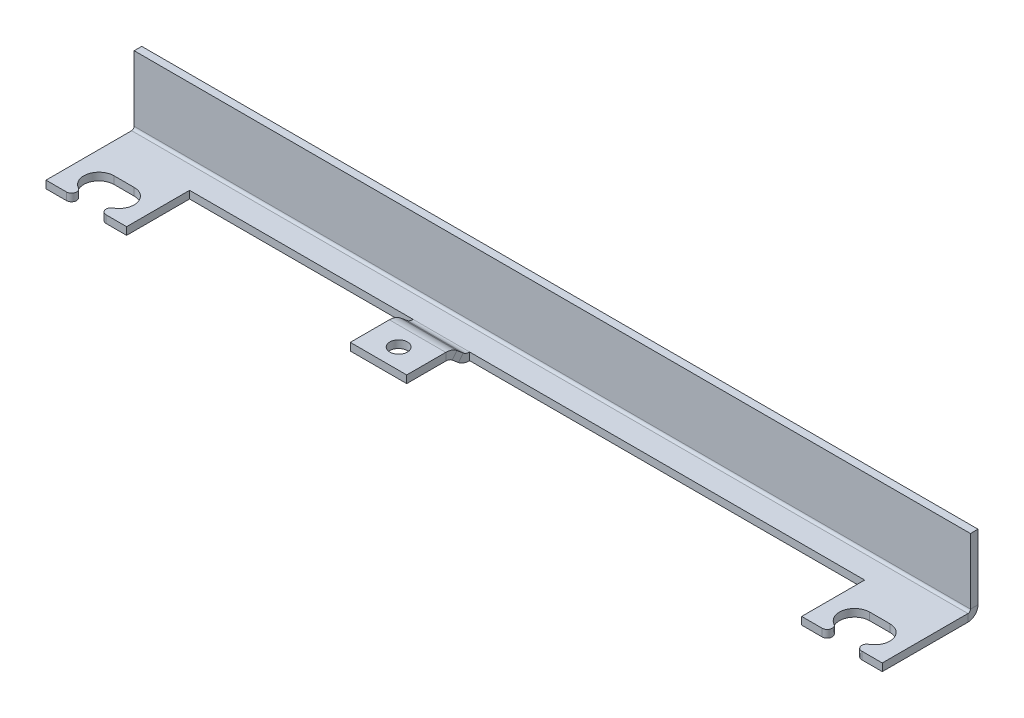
ISO-10303-21;
HEADER;
FILE_DESCRIPTION(('STEP AP214'),'2;1');
FILE_NAME('part.step','',(''),(''),'','','');
FILE_SCHEMA(('AUTOMOTIVE_DESIGN { 1 0 10303 214 1 1 1 1 }'));
ENDSEC;
DATA;
#1=APPLICATION_CONTEXT('core data for automotive mechanical design processes');
#2=APPLICATION_PROTOCOL_DEFINITION('international standard','automotive_design',2000,#1);
#3=PRODUCT_CONTEXT('',#1,'mechanical');
#4=PRODUCT('Part','Part','',(#3));
#5=PRODUCT_RELATED_PRODUCT_CATEGORY('part','',(#4));
#6=PRODUCT_DEFINITION_FORMATION('','',#4);
#7=PRODUCT_DEFINITION_CONTEXT('part definition',#1,'design');
#8=PRODUCT_DEFINITION('design','',#6,#7);
#9=PRODUCT_DEFINITION_SHAPE('','',#8);
#10=(LENGTH_UNIT() NAMED_UNIT(*) SI_UNIT(.MILLI.,.METRE.));
#11=(NAMED_UNIT(*) PLANE_ANGLE_UNIT() SI_UNIT($,.RADIAN.));
#12=(NAMED_UNIT(*) SI_UNIT($,.STERADIAN.) SOLID_ANGLE_UNIT());
#13=UNCERTAINTY_MEASURE_WITH_UNIT(LENGTH_MEASURE(1.E-05),#10,'distance_accuracy_value','');
#14=(GEOMETRIC_REPRESENTATION_CONTEXT(3) GLOBAL_UNCERTAINTY_ASSIGNED_CONTEXT((#13)) GLOBAL_UNIT_ASSIGNED_CONTEXT((#10,
#11,#12)) REPRESENTATION_CONTEXT('',''));
#15=CARTESIAN_POINT('',(0.,0.,0.));
#16=DIRECTION('',(0.,0.,1.));
#17=DIRECTION('',(1.,0.,0.));
#18=AXIS2_PLACEMENT_3D('',#15,#16,#17);
#19=CARTESIAN_POINT('',(177.4,37.3140353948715,-199.475186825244));
#20=DIRECTION('',(-1.,0.,0.));
#21=DIRECTION('',(0.,-1.,0.));
#22=AXIS2_PLACEMENT_3D('',#19,#20,#21);
#23=PLANE('',#22);
#24=DIRECTION('',(0.,0.642787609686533,0.766044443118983));
#25=VECTOR('',#24,1.);
#26=CARTESIAN_POINT('',(177.4,37.3140353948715,-199.475186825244));
#27=LINE('',#26,#25);
#28=CARTESIAN_POINT('',(177.4,35.8144460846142,-201.26232777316));
#29=VERTEX_POINT('',#28);
#30=CARTESIAN_POINT('',(177.4,36.8505226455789,-200.027579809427));
#31=VERTEX_POINT('',#30);
#32=EDGE_CURVE('E369',#29,#31,#27,.T.);
#33=ORIENTED_EDGE('',*,*,#32,.T.);
#34=DIRECTION('',(0.,0.76604444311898,-0.642787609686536));
#35=VECTOR('',#34,1.);
#36=CARTESIAN_POINT('',(177.4,36.8505226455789,-200.027579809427));
#37=LINE('',#36,#35);
#38=CARTESIAN_POINT('',(177.4,37.9995893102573,-200.991761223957));
#39=VERTEX_POINT('',#38);
#40=EDGE_CURVE('E357',#31,#39,#37,.T.);
#41=ORIENTED_EDGE('',*,*,#40,.T.);
#42=DIRECTION('',(0.,-0.642787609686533,-0.766044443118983));
#43=VECTOR('',#42,1.);
#44=CARTESIAN_POINT('',(177.4,36.5,-202.778902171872));
#45=LINE('',#44,#43);
#46=CARTESIAN_POINT('',(177.4,36.9635127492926,-202.226509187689));
#47=VERTEX_POINT('',#46);
#48=EDGE_CURVE('E373',#47,#39,#45,.F.);
#49=ORIENTED_EDGE('',*,*,#48,.F.);
#50=DIRECTION('',(0.,-0.766044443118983,0.642787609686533));
#51=VECTOR('',#50,1.);
#52=CARTESIAN_POINT('',(177.4,35.8144460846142,-201.26232777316));
#53=LINE('',#52,#51);
#54=EDGE_CURVE('E364',#47,#29,#53,.T.);
#55=ORIENTED_EDGE('',*,*,#54,.T.);
#56=EDGE_LOOP('',(#33,#41,#49,#55));
#57=FACE_BOUND('',#56,.T.);
#58=ADVANCED_FACE('F78',(#57),#23,.T.);
#59=CARTESIAN_POINT('',(188.6,35.3509333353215,-201.814720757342));
#60=DIRECTION('',(0.,-0.766044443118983,0.642787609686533));
#61=DIRECTION('',(0.,-0.642787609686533,-0.766044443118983));
#62=AXIS2_PLACEMENT_3D('',#59,#60,#61);
#63=PLANE('',#62);
#64=DIRECTION('',(0.,-0.642787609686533,-0.766044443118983));
#65=VECTOR('',#64,1.);
#66=CARTESIAN_POINT('',(188.6,35.3509333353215,-201.814720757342));
#67=LINE('',#66,#65);
#68=CARTESIAN_POINT('',(188.6,36.8505226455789,-200.027579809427));
#69=VERTEX_POINT('',#68);
#70=CARTESIAN_POINT('',(188.6,35.8144460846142,-201.26232777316));
#71=VERTEX_POINT('',#70);
#72=EDGE_CURVE('E366',#69,#71,#67,.T.);
#73=ORIENTED_EDGE('',*,*,#72,.F.);
#74=DIRECTION('',(-1.,0.,0.));
#75=VECTOR('',#74,1.);
#76=CARTESIAN_POINT('',(177.4,36.8505226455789,-200.027579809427));
#77=LINE('',#76,#75);
#78=EDGE_CURVE('E102',#31,#69,#77,.F.);
#79=ORIENTED_EDGE('',*,*,#78,.F.);
#80=ORIENTED_EDGE('',*,*,#32,.F.);
#81=DIRECTION('',(1.,0.,0.));
#82=VECTOR('',#81,1.);
#83=CARTESIAN_POINT('',(188.6,35.8144460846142,-201.26232777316));
#84=LINE('',#83,#82);
#85=EDGE_CURVE('E376',#29,#71,#84,.T.);
#86=ORIENTED_EDGE('',*,*,#85,.T.);
#87=EDGE_LOOP('',(#73,#79,#80,#86));
#88=FACE_BOUND('',#87,.T.);
#89=ADVANCED_FACE('F607',(#88),#63,.T.);
#90=CARTESIAN_POINT('',(188.6,36.5,-202.778902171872));
#91=DIRECTION('',(0.,-0.766044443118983,0.642787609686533));
#92=DIRECTION('',(0.,-0.642787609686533,-0.766044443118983));
#93=AXIS2_PLACEMENT_3D('',#90,#91,#92);
#94=PLANE('',#93);
#95=DIRECTION('',(-1.,0.,0.));
#96=VECTOR('',#95,1.);
#97=CARTESIAN_POINT('',(177.4,37.9995893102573,-200.991761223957));
#98=LINE('',#97,#96);
#99=CARTESIAN_POINT('',(188.6,37.9995893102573,-200.991761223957));
#100=VERTEX_POINT('',#99);
#101=EDGE_CURVE('E310',#39,#100,#98,.F.);
#102=ORIENTED_EDGE('',*,*,#101,.T.);
#103=DIRECTION('',(0.,0.642787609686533,0.766044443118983));
#104=VECTOR('',#103,1.);
#105=CARTESIAN_POINT('',(188.6,36.5,-202.778902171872));
#106=LINE('',#105,#104);
#107=CARTESIAN_POINT('',(188.6,36.9635127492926,-202.226509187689));
#108=VERTEX_POINT('',#107);
#109=EDGE_CURVE('E371',#100,#108,#106,.F.);
#110=ORIENTED_EDGE('',*,*,#109,.T.);
#111=DIRECTION('',(-1.,0.,0.));
#112=VECTOR('',#111,1.);
#113=CARTESIAN_POINT('',(177.4,36.9635127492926,-202.226509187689));
#114=LINE('',#113,#112);
#115=EDGE_CURVE('E382',#47,#108,#114,.F.);
#116=ORIENTED_EDGE('',*,*,#115,.F.);
#117=ORIENTED_EDGE('',*,*,#48,.T.);
#118=EDGE_LOOP('',(#102,#110,#116,#117));
#119=FACE_BOUND('',#118,.T.);
#120=ADVANCED_FACE('F655',(#119),#94,.F.);
#121=CARTESIAN_POINT('',(133.,36.5,-203.5));
#122=DIRECTION('',(0.,0.,-1.));
#123=DIRECTION('',(-1.,0.,0.));
#124=AXIS2_PLACEMENT_3D('',#121,#122,#123);
#125=PLANE('',#124);
#126=DIRECTION('',(0.,-1.,0.));
#127=VECTOR('',#126,1.);
#128=CARTESIAN_POINT('',(177.4,36.5,-203.5));
#129=LINE('',#128,#127);
#130=CARTESIAN_POINT('',(177.4,36.5,-203.5));
#131=VERTEX_POINT('',#130);
#132=CARTESIAN_POINT('',(177.4,35.,-203.5));
#133=VERTEX_POINT('',#132);
#134=EDGE_CURVE('E392',#131,#133,#129,.T.);
#135=ORIENTED_EDGE('',*,*,#134,.F.);
#136=DIRECTION('',(1.,0.,0.));
#137=VECTOR('',#136,1.);
#138=CARTESIAN_POINT('',(133.,36.5,-203.5));
#139=LINE('',#138,#137);
#140=CARTESIAN_POINT('',(133.,36.5,-203.5));
#141=VERTEX_POINT('',#140);
#142=EDGE_CURVE('E445',#141,#131,#139,.T.);
#143=ORIENTED_EDGE('',*,*,#142,.F.);
#144=DIRECTION('',(0.,-1.,0.));
#145=VECTOR('',#144,1.);
#146=CARTESIAN_POINT('',(133.,36.5,-203.5));
#147=LINE('',#146,#145);
#148=CARTESIAN_POINT('',(133.,35.,-203.5));
#149=VERTEX_POINT('',#148);
#150=EDGE_CURVE('E529',#141,#149,#147,.T.);
#151=ORIENTED_EDGE('',*,*,#150,.T.);
#152=DIRECTION('',(1.,0.,0.));
#153=VECTOR('',#152,1.);
#154=CARTESIAN_POINT('',(133.,35.,-203.5));
#155=LINE('',#154,#153);
#156=EDGE_CURVE('E446',#149,#133,#155,.T.);
#157=ORIENTED_EDGE('',*,*,#156,.T.);
#158=EDGE_LOOP('',(#135,#143,#151,#157));
#159=FACE_BOUND('',#158,.T.);
#160=ADVANCED_FACE('F443',(#159),#125,.F.);
#161=CARTESIAN_POINT('',(117.,36.5,-210.));
#162=DIRECTION('',(1.,0.,0.));
#163=DIRECTION('',(0.,0.,-1.));
#164=AXIS2_PLACEMENT_3D('',#161,#162,#163);
#165=PLANE('',#164);
#166=DIRECTION('',(0.,-1.,0.));
#167=VECTOR('',#166,1.);
#168=CARTESIAN_POINT('',(117.,36.5,-208.));
#169=LINE('',#168,#167);
#170=CARTESIAN_POINT('',(117.,36.5,-208.));
#171=VERTEX_POINT('',#170);
#172=CARTESIAN_POINT('',(117.,35.,-208.));
#173=VERTEX_POINT('',#172);
#174=EDGE_CURVE('E807',#171,#173,#169,.T.);
#175=ORIENTED_EDGE('',*,*,#174,.T.);
#176=DIRECTION('',(0.,0.,1.));
#177=VECTOR('',#176,1.);
#178=CARTESIAN_POINT('',(117.,35.,-210.));
#179=LINE('',#178,#177);
#180=CARTESIAN_POINT('',(117.,35.,-191.));
#181=VERTEX_POINT('',#180);
#182=EDGE_CURVE('E485',#173,#181,#179,.T.);
#183=ORIENTED_EDGE('',*,*,#182,.T.);
#184=DIRECTION('',(0.,-1.,0.));
#185=VECTOR('',#184,1.);
#186=CARTESIAN_POINT('',(117.,36.5,-191.));
#187=LINE('',#186,#185);
#188=CARTESIAN_POINT('',(117.,36.5,-191.));
#189=VERTEX_POINT('',#188);
#190=EDGE_CURVE('E13',#189,#181,#187,.T.);
#191=ORIENTED_EDGE('',*,*,#190,.F.);
#192=DIRECTION('',(0.,0.,1.));
#193=VECTOR('',#192,1.);
#194=CARTESIAN_POINT('',(117.,36.5,-210.));
#195=LINE('',#194,#193);
#196=EDGE_CURVE('E560',#171,#189,#195,.T.);
#197=ORIENTED_EDGE('',*,*,#196,.F.);
#198=EDGE_LOOP('',(#175,#183,#191,#197));
#199=FACE_BOUND('',#198,.T.);
#200=ADVANCED_FACE('F80',(#199),#165,.F.);
#201=CARTESIAN_POINT('',(283.,36.5,-210.));
#202=DIRECTION('',(-1.,0.,0.));
#203=DIRECTION('',(0.,0.,1.));
#204=AXIS2_PLACEMENT_3D('',#201,#202,#203);
#205=PLANE('',#204);
#206=DIRECTION('',(0.,-1.,0.));
#207=VECTOR('',#206,1.);
#208=CARTESIAN_POINT('',(283.,36.5,-208.));
#209=LINE('',#208,#207);
#210=CARTESIAN_POINT('',(283.,36.5,-208.));
#211=VERTEX_POINT('',#210);
#212=CARTESIAN_POINT('',(283.,35.,-208.));
#213=VERTEX_POINT('',#212);
#214=EDGE_CURVE('E488',#211,#213,#209,.T.);
#215=ORIENTED_EDGE('',*,*,#214,.F.);
#216=DIRECTION('',(0.,0.,-1.));
#217=VECTOR('',#216,1.);
#218=CARTESIAN_POINT('',(283.,36.5,-210.));
#219=LINE('',#218,#217);
#220=CARTESIAN_POINT('',(283.,36.5,-191.));
#221=VERTEX_POINT('',#220);
#222=EDGE_CURVE('E481',#221,#211,#219,.T.);
#223=ORIENTED_EDGE('',*,*,#222,.F.);
#224=DIRECTION('',(0.,-1.,0.));
#225=VECTOR('',#224,1.);
#226=CARTESIAN_POINT('',(283.,36.5,-191.));
#227=LINE('',#226,#225);
#228=CARTESIAN_POINT('',(283.,35.,-191.));
#229=VERTEX_POINT('',#228);
#230=EDGE_CURVE('E484',#221,#229,#227,.T.);
#231=ORIENTED_EDGE('',*,*,#230,.T.);
#232=DIRECTION('',(0.,0.,-1.));
#233=VECTOR('',#232,1.);
#234=CARTESIAN_POINT('',(283.,35.,-210.));
#235=LINE('',#234,#233);
#236=EDGE_CURVE('E557',#229,#213,#235,.T.);
#237=ORIENTED_EDGE('',*,*,#236,.T.);
#238=EDGE_LOOP('',(#215,#223,#231,#237));
#239=FACE_BOUND('',#238,.T.);
#240=ADVANCED_FACE('F706',(#239),#205,.F.);
#241=CARTESIAN_POINT('',(278.936491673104,36.5,-192.));
#242=DIRECTION('',(0.,-1.,0.));
#243=DIRECTION('',(0.,0.,-1.));
#244=AXIS2_PLACEMENT_3D('',#241,#242,#243);
#245=PLANE('',#244);
#246=DIRECTION('',(-1.,0.,0.));
#247=VECTOR('',#246,1.);
#248=CARTESIAN_POINT('',(117.,36.5,-208.));
#249=LINE('',#248,#247);
#250=EDGE_CURVE('E816',#171,#211,#249,.F.);
#251=ORIENTED_EDGE('',*,*,#250,.F.);
#252=ORIENTED_EDGE('',*,*,#196,.T.);
#253=DIRECTION('',(1.,0.,0.));
#254=VECTOR('',#253,1.);
#255=CARTESIAN_POINT('',(117.,36.5,-191.));
#256=LINE('',#255,#254);
#257=CARTESIAN_POINT('',(121.063508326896,36.5,-191.));
#258=VERTEX_POINT('',#257);
#259=EDGE_CURVE('E804',#189,#258,#256,.T.);
#260=ORIENTED_EDGE('',*,*,#259,.T.);
#261=CARTESIAN_POINT('',(121.063508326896,36.5,-192.));
#262=DIRECTION('',(0.,1.,0.));
#263=DIRECTION('',(0.,0.,1.));
#264=AXIS2_PLACEMENT_3D('',#261,#262,#263);
#265=CIRCLE('',#264,0.999999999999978);
#266=CARTESIAN_POINT('',(121.547631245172,36.5,-192.875));
#267=VERTEX_POINT('',#266);
#268=EDGE_CURVE('E776',#258,#267,#265,.T.);
#269=ORIENTED_EDGE('',*,*,#268,.T.);
#270=CARTESIAN_POINT('',(123.,36.5,-195.5));
#271=DIRECTION('',(0.,-1.,0.));
#272=DIRECTION('',(0.,0.,-1.));
#273=AXIS2_PLACEMENT_3D('',#270,#271,#272);
#274=CIRCLE('',#273,3.00000000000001);
#275=CARTESIAN_POINT('',(123.,36.5,-198.5));
#276=VERTEX_POINT('',#275);
#277=EDGE_CURVE('E787',#267,#276,#274,.T.);
#278=ORIENTED_EDGE('',*,*,#277,.T.);
#279=DIRECTION('',(1.,0.,0.));
#280=VECTOR('',#279,1.);
#281=CARTESIAN_POINT('',(123.,36.5,-198.5));
#282=LINE('',#281,#280);
#283=CARTESIAN_POINT('',(127.,36.5,-198.5));
#284=VERTEX_POINT('',#283);
#285=EDGE_CURVE('E784',#276,#284,#282,.T.);
#286=ORIENTED_EDGE('',*,*,#285,.T.);
#287=CARTESIAN_POINT('',(127.,36.5,-195.5));
#288=DIRECTION('',(0.,-1.,0.));
#289=DIRECTION('',(0.,0.,1.));
#290=AXIS2_PLACEMENT_3D('',#287,#288,#289);
#291=CIRCLE('',#290,3.);
#292=CARTESIAN_POINT('',(128.452368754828,36.5,-192.875));
#293=VERTEX_POINT('',#292);
#294=EDGE_CURVE('E786',#284,#293,#291,.T.);
#295=ORIENTED_EDGE('',*,*,#294,.T.);
#296=CARTESIAN_POINT('',(128.936491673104,36.5,-192.));
#297=DIRECTION('',(0.,1.,0.));
#298=DIRECTION('',(0.,0.,-1.));
#299=AXIS2_PLACEMENT_3D('',#296,#297,#298);
#300=CIRCLE('',#299,0.999999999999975);
#301=CARTESIAN_POINT('',(128.936491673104,36.5,-191.));
#302=VERTEX_POINT('',#301);
#303=EDGE_CURVE('E789',#293,#302,#300,.T.);
#304=ORIENTED_EDGE('',*,*,#303,.T.);
#305=DIRECTION('',(1.,0.,0.));
#306=VECTOR('',#305,1.);
#307=CARTESIAN_POINT('',(133.,36.5,-191.));
#308=LINE('',#307,#306);
#309=CARTESIAN_POINT('',(133.,36.5,-191.));
#310=VERTEX_POINT('',#309);
#311=EDGE_CURVE('E794',#302,#310,#308,.T.);
#312=ORIENTED_EDGE('',*,*,#311,.T.);
#313=DIRECTION('',(0.,0.,-1.));
#314=VECTOR('',#313,1.);
#315=CARTESIAN_POINT('',(133.,36.5,-191.));
#316=LINE('',#315,#314);
#317=EDGE_CURVE('E450',#310,#141,#316,.T.);
#318=ORIENTED_EDGE('',*,*,#317,.T.);
#319=ORIENTED_EDGE('',*,*,#142,.T.);
#320=DIRECTION('',(1.,0.,0.));
#321=VECTOR('',#320,1.);
#322=CARTESIAN_POINT('',(188.6,36.5,-203.5));
#323=LINE('',#322,#321);
#324=CARTESIAN_POINT('',(188.6,36.5,-203.5));
#325=VERTEX_POINT('',#324);
#326=EDGE_CURVE('E403',#325,#131,#323,.F.);
#327=ORIENTED_EDGE('',*,*,#326,.F.);
#328=CARTESIAN_POINT('',(267.,36.5,-203.5));
#329=VERTEX_POINT('',#328);
#330=EDGE_CURVE('E453',#325,#329,#139,.T.);
#331=ORIENTED_EDGE('',*,*,#330,.T.);
#332=DIRECTION('',(0.,0.,1.));
#333=VECTOR('',#332,1.);
#334=CARTESIAN_POINT('',(267.,36.5,-191.));
#335=LINE('',#334,#333);
#336=CARTESIAN_POINT('',(267.,36.5,-191.));
#337=VERTEX_POINT('',#336);
#338=EDGE_CURVE('E452',#329,#337,#335,.T.);
#339=ORIENTED_EDGE('',*,*,#338,.T.);
#340=DIRECTION('',(1.,0.,0.));
#341=VECTOR('',#340,1.);
#342=CARTESIAN_POINT('',(267.,36.5,-191.));
#343=LINE('',#342,#341);
#344=CARTESIAN_POINT('',(271.063508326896,36.5,-191.));
#345=VERTEX_POINT('',#344);
#346=EDGE_CURVE('E455',#337,#345,#343,.T.);
#347=ORIENTED_EDGE('',*,*,#346,.T.);
#348=CARTESIAN_POINT('',(271.063508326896,36.5,-192.));
#349=DIRECTION('',(0.,1.,0.));
#350=DIRECTION('',(0.,0.,1.));
#351=AXIS2_PLACEMENT_3D('',#348,#349,#350);
#352=CIRCLE('',#351,0.999999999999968);
#353=CARTESIAN_POINT('',(271.547631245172,36.5,-192.875));
#354=VERTEX_POINT('',#353);
#355=EDGE_CURVE('E469',#345,#354,#352,.T.);
#356=ORIENTED_EDGE('',*,*,#355,.T.);
#357=CARTESIAN_POINT('',(273.,36.5,-195.5));
#358=DIRECTION('',(0.,-1.,0.));
#359=DIRECTION('',(0.,0.,-1.));
#360=AXIS2_PLACEMENT_3D('',#357,#358,#359);
#361=CIRCLE('',#360,3.);
#362=CARTESIAN_POINT('',(273.,36.5,-198.5));
#363=VERTEX_POINT('',#362);
#364=EDGE_CURVE('E471',#354,#363,#361,.T.);
#365=ORIENTED_EDGE('',*,*,#364,.T.);
#366=DIRECTION('',(1.,0.,0.));
#367=VECTOR('',#366,1.);
#368=CARTESIAN_POINT('',(277.,36.5,-198.5));
#369=LINE('',#368,#367);
#370=CARTESIAN_POINT('',(277.,36.5,-198.5));
#371=VERTEX_POINT('',#370);
#372=EDGE_CURVE('E473',#363,#371,#369,.T.);
#373=ORIENTED_EDGE('',*,*,#372,.T.);
#374=CARTESIAN_POINT('',(277.,36.5,-195.5));
#375=DIRECTION('',(0.,-1.,0.));
#376=DIRECTION('',(0.,0.,1.));
#377=AXIS2_PLACEMENT_3D('',#374,#375,#376);
#378=CIRCLE('',#377,2.99999999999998);
#379=CARTESIAN_POINT('',(278.452368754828,36.5,-192.875));
#380=VERTEX_POINT('',#379);
#381=EDGE_CURVE('E475',#371,#380,#378,.T.);
#382=ORIENTED_EDGE('',*,*,#381,.T.);
#383=CARTESIAN_POINT('',(278.936491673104,36.5,-192.));
#384=DIRECTION('',(0.,1.,0.));
#385=DIRECTION('',(0.,0.,-1.));
#386=AXIS2_PLACEMENT_3D('',#383,#384,#385);
#387=CIRCLE('',#386,0.999999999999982);
#388=CARTESIAN_POINT('',(278.936491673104,36.5,-191.));
#389=VERTEX_POINT('',#388);
#390=EDGE_CURVE('E477',#380,#389,#387,.T.);
#391=ORIENTED_EDGE('',*,*,#390,.T.);
#392=DIRECTION('',(1.,0.,0.));
#393=VECTOR('',#392,1.);
#394=CARTESIAN_POINT('',(283.,36.5,-191.));
#395=LINE('',#394,#393);
#396=EDGE_CURVE('E479',#389,#221,#395,.T.);
#397=ORIENTED_EDGE('',*,*,#396,.T.);
#398=ORIENTED_EDGE('',*,*,#222,.T.);
#399=EDGE_LOOP('',(#251,#252,#260,#269,#278,#286,#295,#304,#312,#318,#319,#327,#331,#339,#347,
#356,#365,#373,#382,#391,#397,#398));
#400=FACE_BOUND('',#399,.T.);
#401=ADVANCED_FACE('F448',(#400),#245,.F.);
#402=CARTESIAN_POINT('',(278.936491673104,35.,-192.));
#403=DIRECTION('',(0.,-1.,0.));
#404=DIRECTION('',(0.,0.,-1.));
#405=AXIS2_PLACEMENT_3D('',#402,#403,#404);
#406=PLANE('',#405);
#407=ORIENTED_EDGE('',*,*,#182,.F.);
#408=DIRECTION('',(-1.,0.,0.));
#409=VECTOR('',#408,1.);
#410=CARTESIAN_POINT('',(117.,35.,-208.));
#411=LINE('',#410,#409);
#412=EDGE_CURVE('E825',#173,#213,#411,.F.);
#413=ORIENTED_EDGE('',*,*,#412,.T.);
#414=ORIENTED_EDGE('',*,*,#236,.F.);
#415=DIRECTION('',(1.,0.,0.));
#416=VECTOR('',#415,1.);
#417=CARTESIAN_POINT('',(283.,35.,-191.));
#418=LINE('',#417,#416);
#419=CARTESIAN_POINT('',(278.936491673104,35.,-191.));
#420=VERTEX_POINT('',#419);
#421=EDGE_CURVE('E561',#420,#229,#418,.T.);
#422=ORIENTED_EDGE('',*,*,#421,.F.);
#423=CARTESIAN_POINT('',(278.936491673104,35.,-192.));
#424=DIRECTION('',(0.,1.,0.));
#425=DIRECTION('',(0.,0.,-1.));
#426=AXIS2_PLACEMENT_3D('',#423,#424,#425);
#427=CIRCLE('',#426,0.999999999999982);
#428=CARTESIAN_POINT('',(278.452368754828,35.,-192.875));
#429=VERTEX_POINT('',#428);
#430=EDGE_CURVE('E563',#429,#420,#427,.T.);
#431=ORIENTED_EDGE('',*,*,#430,.F.);
#432=CARTESIAN_POINT('',(277.,35.,-195.5));
#433=DIRECTION('',(0.,-1.,0.));
#434=DIRECTION('',(0.,0.,1.));
#435=AXIS2_PLACEMENT_3D('',#432,#433,#434);
#436=CIRCLE('',#435,2.99999999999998);
#437=CARTESIAN_POINT('',(277.,35.,-198.5));
#438=VERTEX_POINT('',#437);
#439=EDGE_CURVE('E565',#438,#429,#436,.T.);
#440=ORIENTED_EDGE('',*,*,#439,.F.);
#441=DIRECTION('',(1.,0.,0.));
#442=VECTOR('',#441,1.);
#443=CARTESIAN_POINT('',(277.,35.,-198.5));
#444=LINE('',#443,#442);
#445=CARTESIAN_POINT('',(273.,35.,-198.5));
#446=VERTEX_POINT('',#445);
#447=EDGE_CURVE('E567',#446,#438,#444,.T.);
#448=ORIENTED_EDGE('',*,*,#447,.F.);
#449=CARTESIAN_POINT('',(273.,35.,-195.5));
#450=DIRECTION('',(0.,-1.,0.));
#451=DIRECTION('',(0.,0.,-1.));
#452=AXIS2_PLACEMENT_3D('',#449,#450,#451);
#453=CIRCLE('',#452,3.);
#454=CARTESIAN_POINT('',(271.547631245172,35.,-192.875));
#455=VERTEX_POINT('',#454);
#456=EDGE_CURVE('E569',#455,#446,#453,.T.);
#457=ORIENTED_EDGE('',*,*,#456,.F.);
#458=CARTESIAN_POINT('',(271.063508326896,35.,-192.));
#459=DIRECTION('',(0.,1.,0.));
#460=DIRECTION('',(0.,0.,1.));
#461=AXIS2_PLACEMENT_3D('',#458,#459,#460);
#462=CIRCLE('',#461,0.999999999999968);
#463=CARTESIAN_POINT('',(271.063508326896,35.,-191.));
#464=VERTEX_POINT('',#463);
#465=EDGE_CURVE('E571',#464,#455,#462,.T.);
#466=ORIENTED_EDGE('',*,*,#465,.F.);
#467=DIRECTION('',(1.,0.,0.));
#468=VECTOR('',#467,1.);
#469=CARTESIAN_POINT('',(267.,35.,-191.));
#470=LINE('',#469,#468);
#471=CARTESIAN_POINT('',(267.,35.,-191.));
#472=VERTEX_POINT('',#471);
#473=EDGE_CURVE('E572',#472,#464,#470,.T.);
#474=ORIENTED_EDGE('',*,*,#473,.F.);
#475=DIRECTION('',(0.,0.,1.));
#476=VECTOR('',#475,1.);
#477=CARTESIAN_POINT('',(267.,35.,-191.));
#478=LINE('',#477,#476);
#479=CARTESIAN_POINT('',(267.,35.,-203.5));
#480=VERTEX_POINT('',#479);
#481=EDGE_CURVE('E505',#480,#472,#478,.T.);
#482=ORIENTED_EDGE('',*,*,#481,.F.);
#483=CARTESIAN_POINT('',(188.6,35.,-203.5));
#484=VERTEX_POINT('',#483);
#485=EDGE_CURVE('E460',#484,#480,#155,.T.);
#486=ORIENTED_EDGE('',*,*,#485,.F.);
#487=DIRECTION('',(1.,0.,0.));
#488=VECTOR('',#487,1.);
#489=CARTESIAN_POINT('',(188.6,35.,-203.5));
#490=LINE('',#489,#488);
#491=EDGE_CURVE('E408',#484,#133,#490,.F.);
#492=ORIENTED_EDGE('',*,*,#491,.T.);
#493=ORIENTED_EDGE('',*,*,#156,.F.);
#494=DIRECTION('',(0.,0.,-1.));
#495=VECTOR('',#494,1.);
#496=CARTESIAN_POINT('',(133.,35.,-191.));
#497=LINE('',#496,#495);
#498=CARTESIAN_POINT('',(133.,35.,-191.));
#499=VERTEX_POINT('',#498);
#500=EDGE_CURVE('E502',#499,#149,#497,.T.);
#501=ORIENTED_EDGE('',*,*,#500,.F.);
#502=DIRECTION('',(1.,0.,0.));
#503=VECTOR('',#502,1.);
#504=CARTESIAN_POINT('',(133.,35.,-191.));
#505=LINE('',#504,#503);
#506=CARTESIAN_POINT('',(128.936491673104,35.,-191.));
#507=VERTEX_POINT('',#506);
#508=EDGE_CURVE('E500',#507,#499,#505,.T.);
#509=ORIENTED_EDGE('',*,*,#508,.F.);
#510=CARTESIAN_POINT('',(128.936491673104,35.,-192.));
#511=DIRECTION('',(0.,1.,0.));
#512=DIRECTION('',(0.,0.,-1.));
#513=AXIS2_PLACEMENT_3D('',#510,#511,#512);
#514=CIRCLE('',#513,0.999999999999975);
#515=CARTESIAN_POINT('',(128.452368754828,35.,-192.875));
#516=VERTEX_POINT('',#515);
#517=EDGE_CURVE('E498',#516,#507,#514,.T.);
#518=ORIENTED_EDGE('',*,*,#517,.F.);
#519=CARTESIAN_POINT('',(127.,35.,-195.5));
#520=DIRECTION('',(0.,-1.,0.));
#521=DIRECTION('',(0.,0.,1.));
#522=AXIS2_PLACEMENT_3D('',#519,#520,#521);
#523=CIRCLE('',#522,3.);
#524=CARTESIAN_POINT('',(127.,35.,-198.5));
#525=VERTEX_POINT('',#524);
#526=EDGE_CURVE('E496',#525,#516,#523,.T.);
#527=ORIENTED_EDGE('',*,*,#526,.F.);
#528=DIRECTION('',(1.,0.,0.));
#529=VECTOR('',#528,1.);
#530=CARTESIAN_POINT('',(123.,35.,-198.5));
#531=LINE('',#530,#529);
#532=CARTESIAN_POINT('',(123.,35.,-198.5));
#533=VERTEX_POINT('',#532);
#534=EDGE_CURVE('E494',#533,#525,#531,.T.);
#535=ORIENTED_EDGE('',*,*,#534,.F.);
#536=CARTESIAN_POINT('',(123.,35.,-195.5));
#537=DIRECTION('',(0.,-1.,0.));
#538=DIRECTION('',(0.,0.,-1.));
#539=AXIS2_PLACEMENT_3D('',#536,#537,#538);
#540=CIRCLE('',#539,3.00000000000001);
#541=CARTESIAN_POINT('',(121.547631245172,35.,-192.875));
#542=VERTEX_POINT('',#541);
#543=EDGE_CURVE('E492',#542,#533,#540,.T.);
#544=ORIENTED_EDGE('',*,*,#543,.F.);
#545=CARTESIAN_POINT('',(121.063508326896,35.,-192.));
#546=DIRECTION('',(0.,1.,0.));
#547=DIRECTION('',(0.,0.,1.));
#548=AXIS2_PLACEMENT_3D('',#545,#546,#547);
#549=CIRCLE('',#548,0.999999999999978);
#550=CARTESIAN_POINT('',(121.063508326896,35.,-191.));
#551=VERTEX_POINT('',#550);
#552=EDGE_CURVE('E490',#551,#542,#549,.T.);
#553=ORIENTED_EDGE('',*,*,#552,.F.);
#554=DIRECTION('',(1.,0.,0.));
#555=VECTOR('',#554,1.);
#556=CARTESIAN_POINT('',(117.,35.,-191.));
#557=LINE('',#556,#555);
#558=EDGE_CURVE('E487',#181,#551,#557,.T.);
#559=ORIENTED_EDGE('',*,*,#558,.F.);
#560=EDGE_LOOP('',(#407,#413,#414,#422,#431,#440,#448,#457,#466,#474,#482,#486,#492,#493,#501,
#509,#518,#527,#535,#544,#553,#559));
#561=FACE_BOUND('',#560,.T.);
#562=ADVANCED_FACE('F586',(#561),#406,.T.);
#563=CARTESIAN_POINT('',(117.,36.5,-191.));
#564=DIRECTION('',(0.,0.,-1.));
#565=DIRECTION('',(-1.,0.,0.));
#566=AXIS2_PLACEMENT_3D('',#563,#564,#565);
#567=PLANE('',#566);
#568=ORIENTED_EDGE('',*,*,#558,.T.);
#569=DIRECTION('',(0.,-1.,0.));
#570=VECTOR('',#569,1.);
#571=CARTESIAN_POINT('',(121.063508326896,36.5,-191.));
#572=LINE('',#571,#570);
#573=EDGE_CURVE('E87',#258,#551,#572,.T.);
#574=ORIENTED_EDGE('',*,*,#573,.F.);
#575=ORIENTED_EDGE('',*,*,#259,.F.);
#576=ORIENTED_EDGE('',*,*,#190,.T.);
#577=EDGE_LOOP('',(#568,#574,#575,#576));
#578=FACE_BOUND('',#577,.T.);
#579=ADVANCED_FACE('F709',(#578),#567,.F.);
#580=CARTESIAN_POINT('',(121.063508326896,36.5,-192.));
#581=DIRECTION('',(0.,-1.,0.));
#582=DIRECTION('',(0.,0.,-1.));
#583=AXIS2_PLACEMENT_3D('',#580,#581,#582);
#584=CYLINDRICAL_SURFACE('',#583,0.999999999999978);
#585=ORIENTED_EDGE('',*,*,#552,.T.);
#586=DIRECTION('',(0.,-1.,0.));
#587=VECTOR('',#586,1.);
#588=CARTESIAN_POINT('',(121.547631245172,36.5,-192.875));
#589=LINE('',#588,#587);
#590=EDGE_CURVE('E511',#267,#542,#589,.T.);
#591=ORIENTED_EDGE('',*,*,#590,.F.);
#592=ORIENTED_EDGE('',*,*,#268,.F.);
#593=ORIENTED_EDGE('',*,*,#573,.T.);
#594=EDGE_LOOP('',(#585,#591,#592,#593));
#595=FACE_BOUND('',#594,.T.);
#596=ADVANCED_FACE('F761',(#595),#584,.T.);
#597=CARTESIAN_POINT('',(123.,36.5,-195.5));
#598=DIRECTION('',(0.,-1.,0.));
#599=DIRECTION('',(0.,0.,-1.));
#600=AXIS2_PLACEMENT_3D('',#597,#598,#599);
#601=CYLINDRICAL_SURFACE('',#600,3.00000000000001);
#602=ORIENTED_EDGE('',*,*,#543,.T.);
#603=DIRECTION('',(0.,-1.,0.));
#604=VECTOR('',#603,1.);
#605=CARTESIAN_POINT('',(123.,36.5,-198.5));
#606=LINE('',#605,#604);
#607=EDGE_CURVE('E514',#276,#533,#606,.T.);
#608=ORIENTED_EDGE('',*,*,#607,.F.);
#609=ORIENTED_EDGE('',*,*,#277,.F.);
#610=ORIENTED_EDGE('',*,*,#590,.T.);
#611=EDGE_LOOP('',(#602,#608,#609,#610));
#612=FACE_BOUND('',#611,.T.);
#613=ADVANCED_FACE('F757',(#612),#601,.F.);
#614=CARTESIAN_POINT('',(123.,36.5,-198.5));
#615=DIRECTION('',(0.,0.,-1.));
#616=DIRECTION('',(-1.,0.,0.));
#617=AXIS2_PLACEMENT_3D('',#614,#615,#616);
#618=PLANE('',#617);
#619=ORIENTED_EDGE('',*,*,#534,.T.);
#620=DIRECTION('',(0.,-1.,0.));
#621=VECTOR('',#620,1.);
#622=CARTESIAN_POINT('',(127.,36.5,-198.5));
#623=LINE('',#622,#621);
#624=EDGE_CURVE('E517',#284,#525,#623,.T.);
#625=ORIENTED_EDGE('',*,*,#624,.F.);
#626=ORIENTED_EDGE('',*,*,#285,.F.);
#627=ORIENTED_EDGE('',*,*,#607,.T.);
#628=EDGE_LOOP('',(#619,#625,#626,#627));
#629=FACE_BOUND('',#628,.T.);
#630=ADVANCED_FACE('F753',(#629),#618,.F.);
#631=CARTESIAN_POINT('',(127.,36.5,-195.5));
#632=DIRECTION('',(0.,-1.,0.));
#633=DIRECTION('',(0.,0.,-1.));
#634=AXIS2_PLACEMENT_3D('',#631,#632,#633);
#635=CYLINDRICAL_SURFACE('',#634,3.);
#636=ORIENTED_EDGE('',*,*,#526,.T.);
#637=DIRECTION('',(0.,-1.,0.));
#638=VECTOR('',#637,1.);
#639=CARTESIAN_POINT('',(128.452368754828,36.5,-192.875));
#640=LINE('',#639,#638);
#641=EDGE_CURVE('E520',#293,#516,#640,.T.);
#642=ORIENTED_EDGE('',*,*,#641,.F.);
#643=ORIENTED_EDGE('',*,*,#294,.F.);
#644=ORIENTED_EDGE('',*,*,#624,.T.);
#645=EDGE_LOOP('',(#636,#642,#643,#644));
#646=FACE_BOUND('',#645,.T.);
#647=ADVANCED_FACE('F749',(#646),#635,.F.);
#648=CARTESIAN_POINT('',(128.936491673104,36.5,-192.));
#649=DIRECTION('',(0.,-1.,0.));
#650=DIRECTION('',(0.,0.,-1.));
#651=AXIS2_PLACEMENT_3D('',#648,#649,#650);
#652=CYLINDRICAL_SURFACE('',#651,0.999999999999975);
#653=ORIENTED_EDGE('',*,*,#517,.T.);
#654=DIRECTION('',(0.,-1.,0.));
#655=VECTOR('',#654,1.);
#656=CARTESIAN_POINT('',(128.936491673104,36.5,-191.));
#657=LINE('',#656,#655);
#658=EDGE_CURVE('E523',#302,#507,#657,.T.);
#659=ORIENTED_EDGE('',*,*,#658,.F.);
#660=ORIENTED_EDGE('',*,*,#303,.F.);
#661=ORIENTED_EDGE('',*,*,#641,.T.);
#662=EDGE_LOOP('',(#653,#659,#660,#661));
#663=FACE_BOUND('',#662,.T.);
#664=ADVANCED_FACE('F745',(#663),#652,.T.);
#665=CARTESIAN_POINT('',(133.,36.5,-191.));
#666=DIRECTION('',(0.,0.,-1.));
#667=DIRECTION('',(-1.,0.,0.));
#668=AXIS2_PLACEMENT_3D('',#665,#666,#667);
#669=PLANE('',#668);
#670=ORIENTED_EDGE('',*,*,#508,.T.);
#671=DIRECTION('',(0.,-1.,0.));
#672=VECTOR('',#671,1.);
#673=CARTESIAN_POINT('',(133.,36.5,-191.));
#674=LINE('',#673,#672);
#675=EDGE_CURVE('E526',#310,#499,#674,.T.);
#676=ORIENTED_EDGE('',*,*,#675,.F.);
#677=ORIENTED_EDGE('',*,*,#311,.F.);
#678=ORIENTED_EDGE('',*,*,#658,.T.);
#679=EDGE_LOOP('',(#670,#676,#677,#678));
#680=FACE_BOUND('',#679,.T.);
#681=ADVANCED_FACE('F741',(#680),#669,.F.);
#682=CARTESIAN_POINT('',(133.,36.5,-191.));
#683=DIRECTION('',(-1.,0.,0.));
#684=DIRECTION('',(0.,0.,1.));
#685=AXIS2_PLACEMENT_3D('',#682,#683,#684);
#686=PLANE('',#685);
#687=ORIENTED_EDGE('',*,*,#500,.T.);
#688=ORIENTED_EDGE('',*,*,#150,.F.);
#689=ORIENTED_EDGE('',*,*,#317,.F.);
#690=ORIENTED_EDGE('',*,*,#675,.T.);
#691=EDGE_LOOP('',(#687,#688,#689,#690));
#692=FACE_BOUND('',#691,.T.);
#693=ADVANCED_FACE('F738',(#692),#686,.F.);
#694=ORIENTED_EDGE('',*,*,#330,.F.);
#695=DIRECTION('',(0.,-1.,0.));
#696=VECTOR('',#695,1.);
#697=CARTESIAN_POINT('',(188.6,36.5,-203.5));
#698=LINE('',#697,#696);
#699=EDGE_CURVE('E396',#325,#484,#698,.T.);
#700=ORIENTED_EDGE('',*,*,#699,.T.);
#701=ORIENTED_EDGE('',*,*,#485,.T.);
#702=DIRECTION('',(0.,-1.,0.));
#703=VECTOR('',#702,1.);
#704=CARTESIAN_POINT('',(267.,36.5,-203.5));
#705=LINE('',#704,#703);
#706=EDGE_CURVE('E531',#329,#480,#705,.T.);
#707=ORIENTED_EDGE('',*,*,#706,.F.);
#708=EDGE_LOOP('',(#694,#700,#701,#707));
#709=FACE_BOUND('',#708,.T.);
#710=ADVANCED_FACE('F600',(#709),#125,.F.);
#711=CARTESIAN_POINT('',(267.,36.5,-191.));
#712=DIRECTION('',(1.,0.,0.));
#713=DIRECTION('',(0.,0.,-1.));
#714=AXIS2_PLACEMENT_3D('',#711,#712,#713);
#715=PLANE('',#714);
#716=ORIENTED_EDGE('',*,*,#481,.T.);
#717=DIRECTION('',(0.,-1.,0.));
#718=VECTOR('',#717,1.);
#719=CARTESIAN_POINT('',(267.,36.5,-191.));
#720=LINE('',#719,#718);
#721=EDGE_CURVE('E534',#337,#472,#720,.T.);
#722=ORIENTED_EDGE('',*,*,#721,.F.);
#723=ORIENTED_EDGE('',*,*,#338,.F.);
#724=ORIENTED_EDGE('',*,*,#706,.T.);
#725=EDGE_LOOP('',(#716,#722,#723,#724));
#726=FACE_BOUND('',#725,.T.);
#727=ADVANCED_FACE('F579',(#726),#715,.F.);
#728=CARTESIAN_POINT('',(267.,36.5,-191.));
#729=DIRECTION('',(0.,0.,-1.));
#730=DIRECTION('',(-1.,0.,0.));
#731=AXIS2_PLACEMENT_3D('',#728,#729,#730);
#732=PLANE('',#731);
#733=ORIENTED_EDGE('',*,*,#473,.T.);
#734=DIRECTION('',(0.,-1.,0.));
#735=VECTOR('',#734,1.);
#736=CARTESIAN_POINT('',(271.063508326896,36.5,-191.));
#737=LINE('',#736,#735);
#738=EDGE_CURVE('E537',#345,#464,#737,.T.);
#739=ORIENTED_EDGE('',*,*,#738,.F.);
#740=ORIENTED_EDGE('',*,*,#346,.F.);
#741=ORIENTED_EDGE('',*,*,#721,.T.);
#742=EDGE_LOOP('',(#733,#739,#740,#741));
#743=FACE_BOUND('',#742,.T.);
#744=ADVANCED_FACE('F583',(#743),#732,.F.);
#745=CARTESIAN_POINT('',(271.063508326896,36.5,-192.));
#746=DIRECTION('',(0.,-1.,0.));
#747=DIRECTION('',(0.,0.,-1.));
#748=AXIS2_PLACEMENT_3D('',#745,#746,#747);
#749=CYLINDRICAL_SURFACE('',#748,0.999999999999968);
#750=ORIENTED_EDGE('',*,*,#465,.T.);
#751=DIRECTION('',(0.,-1.,0.));
#752=VECTOR('',#751,1.);
#753=CARTESIAN_POINT('',(271.547631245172,36.5,-192.875));
#754=LINE('',#753,#752);
#755=EDGE_CURVE('E540',#354,#455,#754,.T.);
#756=ORIENTED_EDGE('',*,*,#755,.F.);
#757=ORIENTED_EDGE('',*,*,#355,.F.);
#758=ORIENTED_EDGE('',*,*,#738,.T.);
#759=EDGE_LOOP('',(#750,#756,#757,#758));
#760=FACE_BOUND('',#759,.T.);
#761=ADVANCED_FACE('F591',(#760),#749,.T.);
#762=CARTESIAN_POINT('',(273.,36.5,-195.5));
#763=DIRECTION('',(0.,-1.,0.));
#764=DIRECTION('',(0.,0.,-1.));
#765=AXIS2_PLACEMENT_3D('',#762,#763,#764);
#766=CYLINDRICAL_SURFACE('',#765,3.);
#767=ORIENTED_EDGE('',*,*,#456,.T.);
#768=DIRECTION('',(0.,-1.,0.));
#769=VECTOR('',#768,1.);
#770=CARTESIAN_POINT('',(273.,36.5,-198.5));
#771=LINE('',#770,#769);
#772=EDGE_CURVE('E543',#363,#446,#771,.T.);
#773=ORIENTED_EDGE('',*,*,#772,.F.);
#774=ORIENTED_EDGE('',*,*,#364,.F.);
#775=ORIENTED_EDGE('',*,*,#755,.T.);
#776=EDGE_LOOP('',(#767,#773,#774,#775));
#777=FACE_BOUND('',#776,.T.);
#778=ADVANCED_FACE('F595',(#777),#766,.F.);
#779=CARTESIAN_POINT('',(277.,36.5,-198.5));
#780=DIRECTION('',(0.,0.,-1.));
#781=DIRECTION('',(-1.,0.,0.));
#782=AXIS2_PLACEMENT_3D('',#779,#780,#781);
#783=PLANE('',#782);
#784=ORIENTED_EDGE('',*,*,#447,.T.);
#785=DIRECTION('',(0.,-1.,0.));
#786=VECTOR('',#785,1.);
#787=CARTESIAN_POINT('',(277.,36.5,-198.5));
#788=LINE('',#787,#786);
#789=EDGE_CURVE('E546',#371,#438,#788,.T.);
#790=ORIENTED_EDGE('',*,*,#789,.F.);
#791=ORIENTED_EDGE('',*,*,#372,.F.);
#792=ORIENTED_EDGE('',*,*,#772,.T.);
#793=EDGE_LOOP('',(#784,#790,#791,#792));
#794=FACE_BOUND('',#793,.T.);
#795=ADVANCED_FACE('F723',(#794),#783,.F.);
#796=CARTESIAN_POINT('',(277.,36.5,-195.5));
#797=DIRECTION('',(0.,-1.,0.));
#798=DIRECTION('',(0.,0.,-1.));
#799=AXIS2_PLACEMENT_3D('',#796,#797,#798);
#800=CYLINDRICAL_SURFACE('',#799,2.99999999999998);
#801=ORIENTED_EDGE('',*,*,#439,.T.);
#802=DIRECTION('',(0.,-1.,0.));
#803=VECTOR('',#802,1.);
#804=CARTESIAN_POINT('',(278.452368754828,36.5,-192.875));
#805=LINE('',#804,#803);
#806=EDGE_CURVE('E549',#380,#429,#805,.T.);
#807=ORIENTED_EDGE('',*,*,#806,.F.);
#808=ORIENTED_EDGE('',*,*,#381,.F.);
#809=ORIENTED_EDGE('',*,*,#789,.T.);
#810=EDGE_LOOP('',(#801,#807,#808,#809));
#811=FACE_BOUND('',#810,.T.);
#812=ADVANCED_FACE('F719',(#811),#800,.F.);
#813=CARTESIAN_POINT('',(278.936491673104,36.5,-192.));
#814=DIRECTION('',(0.,-1.,0.));
#815=DIRECTION('',(0.,0.,-1.));
#816=AXIS2_PLACEMENT_3D('',#813,#814,#815);
#817=CYLINDRICAL_SURFACE('',#816,0.999999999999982);
#818=ORIENTED_EDGE('',*,*,#430,.T.);
#819=DIRECTION('',(0.,-1.,0.));
#820=VECTOR('',#819,1.);
#821=CARTESIAN_POINT('',(278.936491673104,36.5,-191.));
#822=LINE('',#821,#820);
#823=EDGE_CURVE('E552',#389,#420,#822,.T.);
#824=ORIENTED_EDGE('',*,*,#823,.F.);
#825=ORIENTED_EDGE('',*,*,#390,.F.);
#826=ORIENTED_EDGE('',*,*,#806,.T.);
#827=EDGE_LOOP('',(#818,#824,#825,#826));
#828=FACE_BOUND('',#827,.T.);
#829=ADVANCED_FACE('F715',(#828),#817,.T.);
#830=CARTESIAN_POINT('',(283.,36.5,-191.));
#831=DIRECTION('',(0.,0.,-1.));
#832=DIRECTION('',(-1.,0.,0.));
#833=AXIS2_PLACEMENT_3D('',#830,#831,#832);
#834=PLANE('',#833);
#835=ORIENTED_EDGE('',*,*,#421,.T.);
#836=ORIENTED_EDGE('',*,*,#230,.F.);
#837=ORIENTED_EDGE('',*,*,#396,.F.);
#838=ORIENTED_EDGE('',*,*,#823,.T.);
#839=EDGE_LOOP('',(#835,#836,#837,#838));
#840=FACE_BOUND('',#839,.T.);
#841=ADVANCED_FACE('F699',(#840),#834,.F.);
#842=CARTESIAN_POINT('',(283.,37.,-208.));
#843=DIRECTION('',(1.,0.,0.));
#844=DIRECTION('',(0.,0.,-1.));
#845=AXIS2_PLACEMENT_3D('',#842,#843,#844);
#846=PLANE('',#845);
#847=DIRECTION('',(0.,0.,-1.));
#848=VECTOR('',#847,1.);
#849=CARTESIAN_POINT('',(283.,37.,-210.));
#850=LINE('',#849,#848);
#851=CARTESIAN_POINT('',(283.,37.,-208.5));
#852=VERTEX_POINT('',#851);
#853=CARTESIAN_POINT('',(283.,37.,-210.));
#854=VERTEX_POINT('',#853);
#855=EDGE_CURVE('E395',#852,#854,#850,.T.);
#856=ORIENTED_EDGE('',*,*,#855,.F.);
#857=CARTESIAN_POINT('',(283.,37.,-208.));
#858=DIRECTION('',(-1.,0.,0.));
#859=DIRECTION('',(0.,0.,1.));
#860=AXIS2_PLACEMENT_3D('',#857,#858,#859);
#861=CIRCLE('',#860,0.5);
#862=EDGE_CURVE('E819',#211,#852,#861,.F.);
#863=ORIENTED_EDGE('',*,*,#862,.F.);
#864=ORIENTED_EDGE('',*,*,#214,.T.);
#865=CARTESIAN_POINT('',(283.,37.,-208.));
#866=DIRECTION('',(-1.,0.,0.));
#867=DIRECTION('',(0.,0.,1.));
#868=AXIS2_PLACEMENT_3D('',#865,#866,#867);
#869=CIRCLE('',#868,2.);
#870=EDGE_CURVE('E810',#213,#854,#869,.F.);
#871=ORIENTED_EDGE('',*,*,#870,.T.);
#872=EDGE_LOOP('',(#856,#863,#864,#871));
#873=FACE_BOUND('',#872,.T.);
#874=ADVANCED_FACE('F696',(#873),#846,.T.);
#875=CARTESIAN_POINT('',(117.,37.,-208.));
#876=DIRECTION('',(1.,0.,0.));
#877=DIRECTION('',(0.,0.,-1.));
#878=AXIS2_PLACEMENT_3D('',#875,#876,#877);
#879=PLANE('',#878);
#880=CARTESIAN_POINT('',(117.,37.,-208.));
#881=DIRECTION('',(-1.,0.,0.));
#882=DIRECTION('',(0.,0.,1.));
#883=AXIS2_PLACEMENT_3D('',#880,#881,#882);
#884=CIRCLE('',#883,0.5);
#885=CARTESIAN_POINT('',(117.,37.,-208.5));
#886=VERTEX_POINT('',#885);
#887=EDGE_CURVE('E813',#886,#171,#884,.T.);
#888=ORIENTED_EDGE('',*,*,#887,.F.);
#889=DIRECTION('',(0.,0.,-1.));
#890=VECTOR('',#889,1.);
#891=CARTESIAN_POINT('',(117.,37.,-208.5));
#892=LINE('',#891,#890);
#893=CARTESIAN_POINT('',(117.,37.,-210.));
#894=VERTEX_POINT('',#893);
#895=EDGE_CURVE('E834',#886,#894,#892,.T.);
#896=ORIENTED_EDGE('',*,*,#895,.T.);
#897=CARTESIAN_POINT('',(117.,37.,-208.));
#898=DIRECTION('',(-1.,0.,0.));
#899=DIRECTION('',(0.,0.,1.));
#900=AXIS2_PLACEMENT_3D('',#897,#898,#899);
#901=CIRCLE('',#900,2.);
#902=EDGE_CURVE('E822',#894,#173,#901,.T.);
#903=ORIENTED_EDGE('',*,*,#902,.T.);
#904=ORIENTED_EDGE('',*,*,#174,.F.);
#905=EDGE_LOOP('',(#888,#896,#903,#904));
#906=FACE_BOUND('',#905,.T.);
#907=ADVANCED_FACE('F691',(#906),#879,.F.);
#908=CARTESIAN_POINT('',(117.,37.,-208.));
#909=DIRECTION('',(-1.,0.,0.));
#910=DIRECTION('',(0.,0.,-1.));
#911=AXIS2_PLACEMENT_3D('',#908,#909,#910);
#912=CYLINDRICAL_SURFACE('',#911,2.);
#913=ORIENTED_EDGE('',*,*,#412,.F.);
#914=ORIENTED_EDGE('',*,*,#902,.F.);
#915=DIRECTION('',(-1.,0.,0.));
#916=VECTOR('',#915,1.);
#917=CARTESIAN_POINT('',(117.,37.,-210.));
#918=LINE('',#917,#916);
#919=EDGE_CURVE('E837',#854,#894,#918,.T.);
#920=ORIENTED_EDGE('',*,*,#919,.F.);
#921=ORIENTED_EDGE('',*,*,#870,.F.);
#922=EDGE_LOOP('',(#913,#914,#920,#921));
#923=FACE_BOUND('',#922,.T.);
#924=ADVANCED_FACE('F688',(#923),#912,.T.);
#925=CARTESIAN_POINT('',(117.,37.,-208.));
#926=DIRECTION('',(-1.,0.,0.));
#927=DIRECTION('',(0.,0.,-1.));
#928=AXIS2_PLACEMENT_3D('',#925,#926,#927);
#929=CYLINDRICAL_SURFACE('',#928,0.5);
#930=ORIENTED_EDGE('',*,*,#250,.T.);
#931=ORIENTED_EDGE('',*,*,#862,.T.);
#932=DIRECTION('',(1.,0.,0.));
#933=VECTOR('',#932,1.);
#934=CARTESIAN_POINT('',(283.,37.,-208.5));
#935=LINE('',#934,#933);
#936=EDGE_CURVE('E832',#852,#886,#935,.F.);
#937=ORIENTED_EDGE('',*,*,#936,.T.);
#938=ORIENTED_EDGE('',*,*,#887,.T.);
#939=EDGE_LOOP('',(#930,#931,#937,#938));
#940=FACE_BOUND('',#939,.T.);
#941=ADVANCED_FACE('F680',(#940),#929,.F.);
#942=CARTESIAN_POINT('',(117.,36.5,-210.));
#943=DIRECTION('',(-1.,0.,0.));
#944=DIRECTION('',(0.,-1.,0.));
#945=AXIS2_PLACEMENT_3D('',#942,#943,#944);
#946=PLANE('',#945);
#947=DIRECTION('',(0.,-1.,0.));
#948=VECTOR('',#947,1.);
#949=CARTESIAN_POINT('',(117.,36.5,-210.));
#950=LINE('',#949,#948);
#951=CARTESIAN_POINT('',(117.,50.,-210.));
#952=VERTEX_POINT('',#951);
#953=EDGE_CURVE('E853',#952,#894,#950,.T.);
#954=ORIENTED_EDGE('',*,*,#953,.T.);
#955=ORIENTED_EDGE('',*,*,#895,.F.);
#956=DIRECTION('',(0.,1.,0.));
#957=VECTOR('',#956,1.);
#958=CARTESIAN_POINT('',(117.,36.5,-208.5));
#959=LINE('',#958,#957);
#960=CARTESIAN_POINT('',(117.,50.,-208.5));
#961=VERTEX_POINT('',#960);
#962=EDGE_CURVE('E845',#961,#886,#959,.F.);
#963=ORIENTED_EDGE('',*,*,#962,.F.);
#964=DIRECTION('',(0.,0.,1.));
#965=VECTOR('',#964,1.);
#966=CARTESIAN_POINT('',(117.,50.,-210.));
#967=LINE('',#966,#965);
#968=EDGE_CURVE('E817',#952,#961,#967,.T.);
#969=ORIENTED_EDGE('',*,*,#968,.F.);
#970=EDGE_LOOP('',(#954,#955,#963,#969));
#971=FACE_BOUND('',#970,.T.);
#972=ADVANCED_FACE('F677',(#971),#946,.T.);
#973=CARTESIAN_POINT('',(283.,50.,-210.));
#974=DIRECTION('',(1.,0.,0.));
#975=DIRECTION('',(0.,0.,-1.));
#976=AXIS2_PLACEMENT_3D('',#973,#974,#975);
#977=PLANE('',#976);
#978=DIRECTION('',(0.,-1.,0.));
#979=VECTOR('',#978,1.);
#980=CARTESIAN_POINT('',(283.,36.5,-208.5));
#981=LINE('',#980,#979);
#982=CARTESIAN_POINT('',(283.,50.,-208.5));
#983=VERTEX_POINT('',#982);
#984=EDGE_CURVE('E840',#852,#983,#981,.F.);
#985=ORIENTED_EDGE('',*,*,#984,.F.);
#986=ORIENTED_EDGE('',*,*,#855,.T.);
#987=DIRECTION('',(0.,1.,0.));
#988=VECTOR('',#987,1.);
#989=CARTESIAN_POINT('',(283.,50.,-210.));
#990=LINE('',#989,#988);
#991=CARTESIAN_POINT('',(283.,50.,-210.));
#992=VERTEX_POINT('',#991);
#993=EDGE_CURVE('E848',#854,#992,#990,.T.);
#994=ORIENTED_EDGE('',*,*,#993,.T.);
#995=DIRECTION('',(0.,0.,1.));
#996=VECTOR('',#995,1.);
#997=CARTESIAN_POINT('',(283.,50.,-210.));
#998=LINE('',#997,#996);
#999=EDGE_CURVE('E856',#992,#983,#998,.T.);
#1000=ORIENTED_EDGE('',*,*,#999,.T.);
#1001=EDGE_LOOP('',(#985,#986,#994,#1000));
#1002=FACE_BOUND('',#1001,.T.);
#1003=ADVANCED_FACE('F672',(#1002),#977,.T.);
#1004=CARTESIAN_POINT('',(117.,36.5,-210.));
#1005=DIRECTION('',(0.,0.,-1.));
#1006=DIRECTION('',(-1.,0.,0.));
#1007=AXIS2_PLACEMENT_3D('',#1004,#1005,#1006);
#1008=PLANE('',#1007);
#1009=ORIENTED_EDGE('',*,*,#993,.F.);
#1010=ORIENTED_EDGE('',*,*,#919,.T.);
#1011=ORIENTED_EDGE('',*,*,#953,.F.);
#1012=DIRECTION('',(-1.,0.,0.));
#1013=VECTOR('',#1012,1.);
#1014=CARTESIAN_POINT('',(117.,50.,-210.));
#1015=LINE('',#1014,#1013);
#1016=EDGE_CURVE('E850',#992,#952,#1015,.T.);
#1017=ORIENTED_EDGE('',*,*,#1016,.F.);
#1018=EDGE_LOOP('',(#1009,#1010,#1011,#1017));
#1019=FACE_BOUND('',#1018,.T.);
#1020=ADVANCED_FACE('F668',(#1019),#1008,.T.);
#1021=CARTESIAN_POINT('',(117.,36.5,-208.5));
#1022=DIRECTION('',(0.,0.,-1.));
#1023=DIRECTION('',(-1.,0.,0.));
#1024=AXIS2_PLACEMENT_3D('',#1021,#1022,#1023);
#1025=PLANE('',#1024);
#1026=ORIENTED_EDGE('',*,*,#936,.F.);
#1027=ORIENTED_EDGE('',*,*,#984,.T.);
#1028=DIRECTION('',(1.,0.,0.));
#1029=VECTOR('',#1028,1.);
#1030=CARTESIAN_POINT('',(117.,50.,-208.5));
#1031=LINE('',#1030,#1029);
#1032=EDGE_CURVE('E842',#983,#961,#1031,.F.);
#1033=ORIENTED_EDGE('',*,*,#1032,.T.);
#1034=ORIENTED_EDGE('',*,*,#962,.T.);
#1035=EDGE_LOOP('',(#1026,#1027,#1033,#1034));
#1036=FACE_BOUND('',#1035,.T.);
#1037=ADVANCED_FACE('F671',(#1036),#1025,.F.);
#1038=CARTESIAN_POINT('',(117.,50.,-210.));
#1039=DIRECTION('',(0.,1.,0.));
#1040=DIRECTION('',(0.,0.,1.));
#1041=AXIS2_PLACEMENT_3D('',#1038,#1039,#1040);
#1042=PLANE('',#1041);
#1043=ORIENTED_EDGE('',*,*,#1032,.F.);
#1044=ORIENTED_EDGE('',*,*,#999,.F.);
#1045=ORIENTED_EDGE('',*,*,#1016,.T.);
#1046=ORIENTED_EDGE('',*,*,#968,.T.);
#1047=EDGE_LOOP('',(#1043,#1044,#1045,#1046));
#1048=FACE_BOUND('',#1047,.T.);
#1049=ADVANCED_FACE('F665',(#1048),#1042,.T.);
#1050=CARTESIAN_POINT('',(177.4,38.4811999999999,-203.5));
#1051=DIRECTION('',(-1.,0.,0.));
#1052=DIRECTION('',(0.,0.,1.));
#1053=AXIS2_PLACEMENT_3D('',#1050,#1051,#1052);
#1054=PLANE('',#1053);
#1055=ORIENTED_EDGE('',*,*,#54,.F.);
#1056=CARTESIAN_POINT('',(177.4,38.4811999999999,-203.5));
#1057=DIRECTION('',(1.,0.,0.));
#1058=DIRECTION('',(0.,0.,-1.));
#1059=AXIS2_PLACEMENT_3D('',#1056,#1057,#1058);
#1060=CIRCLE('',#1059,1.98119999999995);
#1061=EDGE_CURVE('E399',#131,#47,#1060,.F.);
#1062=ORIENTED_EDGE('',*,*,#1061,.F.);
#1063=ORIENTED_EDGE('',*,*,#134,.T.);
#1064=CARTESIAN_POINT('',(177.4,38.4811999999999,-203.5));
#1065=DIRECTION('',(1.,0.,0.));
#1066=DIRECTION('',(0.,0.,-1.));
#1067=AXIS2_PLACEMENT_3D('',#1064,#1065,#1066);
#1068=CIRCLE('',#1067,3.48119999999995);
#1069=EDGE_CURVE('E406',#133,#29,#1068,.F.);
#1070=ORIENTED_EDGE('',*,*,#1069,.T.);
#1071=EDGE_LOOP('',(#1055,#1062,#1063,#1070));
#1072=FACE_BOUND('',#1071,.T.);
#1073=ADVANCED_FACE('F440',(#1072),#1054,.T.);
#1074=CARTESIAN_POINT('',(188.6,38.4811999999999,-203.5));
#1075=DIRECTION('',(-1.,0.,0.));
#1076=DIRECTION('',(0.,0.,1.));
#1077=AXIS2_PLACEMENT_3D('',#1074,#1075,#1076);
#1078=PLANE('',#1077);
#1079=CARTESIAN_POINT('',(188.6,38.4811999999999,-203.5));
#1080=DIRECTION('',(1.,0.,0.));
#1081=DIRECTION('',(0.,0.,-1.));
#1082=AXIS2_PLACEMENT_3D('',#1079,#1080,#1081);
#1083=CIRCLE('',#1082,1.98119999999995);
#1084=EDGE_CURVE('E368',#108,#325,#1083,.T.);
#1085=ORIENTED_EDGE('',*,*,#1084,.F.);
#1086=DIRECTION('',(0.,-0.766044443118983,0.642787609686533));
#1087=VECTOR('',#1086,1.);
#1088=CARTESIAN_POINT('',(188.6,36.9635127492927,-202.226509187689));
#1089=LINE('',#1088,#1087);
#1090=EDGE_CURVE('E379',#108,#71,#1089,.T.);
#1091=ORIENTED_EDGE('',*,*,#1090,.T.);
#1092=CARTESIAN_POINT('',(188.6,38.4811999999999,-203.5));
#1093=DIRECTION('',(1.,0.,0.));
#1094=DIRECTION('',(0.,0.,-1.));
#1095=AXIS2_PLACEMENT_3D('',#1092,#1093,#1094);
#1096=CIRCLE('',#1095,3.48119999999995);
#1097=EDGE_CURVE('E402',#71,#484,#1096,.T.);
#1098=ORIENTED_EDGE('',*,*,#1097,.T.);
#1099=ORIENTED_EDGE('',*,*,#699,.F.);
#1100=EDGE_LOOP('',(#1085,#1091,#1098,#1099));
#1101=FACE_BOUND('',#1100,.T.);
#1102=ADVANCED_FACE('F602',(#1101),#1078,.F.);
#1103=CARTESIAN_POINT('',(188.6,38.4811999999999,-203.5));
#1104=DIRECTION('',(1.,0.,0.));
#1105=DIRECTION('',(0.,-0.766044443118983,0.642787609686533));
#1106=AXIS2_PLACEMENT_3D('',#1103,#1104,#1105);
#1107=CYLINDRICAL_SURFACE('',#1106,3.48119999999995);
#1108=ORIENTED_EDGE('',*,*,#491,.F.);
#1109=ORIENTED_EDGE('',*,*,#1097,.F.);
#1110=ORIENTED_EDGE('',*,*,#85,.F.);
#1111=ORIENTED_EDGE('',*,*,#1069,.F.);
#1112=EDGE_LOOP('',(#1108,#1109,#1110,#1111));
#1113=FACE_BOUND('',#1112,.T.);
#1114=ADVANCED_FACE('F606',(#1113),#1107,.T.);
#1115=CARTESIAN_POINT('',(188.6,38.4811999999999,-203.5));
#1116=DIRECTION('',(1.,0.,0.));
#1117=DIRECTION('',(0.,-0.766044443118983,0.642787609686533));
#1118=AXIS2_PLACEMENT_3D('',#1115,#1116,#1117);
#1119=CYLINDRICAL_SURFACE('',#1118,1.98119999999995);
#1120=ORIENTED_EDGE('',*,*,#326,.T.);
#1121=ORIENTED_EDGE('',*,*,#1061,.T.);
#1122=ORIENTED_EDGE('',*,*,#115,.T.);
#1123=ORIENTED_EDGE('',*,*,#1084,.T.);
#1124=EDGE_LOOP('',(#1120,#1121,#1122,#1123));
#1125=FACE_BOUND('',#1124,.T.);
#1126=ADVANCED_FACE('F433',(#1125),#1119,.F.);
#1127=CARTESIAN_POINT('',(188.6,35.3509333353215,-201.814720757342));
#1128=DIRECTION('',(1.,0.,0.));
#1129=DIRECTION('',(0.,1.,0.));
#1130=AXIS2_PLACEMENT_3D('',#1127,#1128,#1129);
#1131=PLANE('',#1130);
#1132=DIRECTION('',(0.,0.76604444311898,-0.642787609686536));
#1133=VECTOR('',#1132,1.);
#1134=CARTESIAN_POINT('',(188.6,36.8505226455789,-200.027579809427));
#1135=LINE('',#1134,#1133);
#1136=EDGE_CURVE('E95',#69,#100,#1135,.T.);
#1137=ORIENTED_EDGE('',*,*,#1136,.F.);
#1138=ORIENTED_EDGE('',*,*,#72,.T.);
#1139=ORIENTED_EDGE('',*,*,#1090,.F.);
#1140=ORIENTED_EDGE('',*,*,#109,.F.);
#1141=EDGE_LOOP('',(#1137,#1138,#1139,#1140));
#1142=FACE_BOUND('',#1141,.T.);
#1143=ADVANCED_FACE('F641',(#1142),#1131,.T.);
#1144=CARTESIAN_POINT('',(188.6,35.3328353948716,-198.754088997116));
#1145=DIRECTION('',(1.,0.,0.));
#1146=DIRECTION('',(0.,0.,-1.));
#1147=AXIS2_PLACEMENT_3D('',#1144,#1145,#1146);
#1148=PLANE('',#1147);
#1149=DIRECTION('',(0.,1.,0.));
#1150=VECTOR('',#1149,1.);
#1151=CARTESIAN_POINT('',(188.6,37.3140353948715,-198.754088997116));
#1152=LINE('',#1151,#1150);
#1153=CARTESIAN_POINT('',(188.6,37.3140353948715,-198.754088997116));
#1154=VERTEX_POINT('',#1153);
#1155=CARTESIAN_POINT('',(188.6,38.8140353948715,-198.754088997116));
#1156=VERTEX_POINT('',#1155);
#1157=EDGE_CURVE('E616',#1154,#1156,#1152,.T.);
#1158=ORIENTED_EDGE('',*,*,#1157,.F.);
#1159=CARTESIAN_POINT('',(188.6,35.3328353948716,-198.754088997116));
#1160=DIRECTION('',(-1.,0.,0.));
#1161=DIRECTION('',(0.,0.,1.));
#1162=AXIS2_PLACEMENT_3D('',#1159,#1160,#1161);
#1163=CIRCLE('',#1162,1.98119999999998);
#1164=EDGE_CURVE('E313',#69,#1154,#1163,.F.);
#1165=ORIENTED_EDGE('',*,*,#1164,.F.);
#1166=ORIENTED_EDGE('',*,*,#1136,.T.);
#1167=CARTESIAN_POINT('',(188.6,35.3328353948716,-198.754088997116));
#1168=DIRECTION('',(-1.,0.,0.));
#1169=DIRECTION('',(0.,0.,1.));
#1170=AXIS2_PLACEMENT_3D('',#1167,#1168,#1169);
#1171=CIRCLE('',#1170,3.48119999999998);
#1172=EDGE_CURVE('E356',#100,#1156,#1171,.F.);
#1173=ORIENTED_EDGE('',*,*,#1172,.T.);
#1174=EDGE_LOOP('',(#1158,#1165,#1166,#1173));
#1175=FACE_BOUND('',#1174,.T.);
#1176=ADVANCED_FACE('F639',(#1175),#1148,.T.);
#1177=CARTESIAN_POINT('',(177.4,35.3328353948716,-198.754088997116));
#1178=DIRECTION('',(1.,0.,0.));
#1179=DIRECTION('',(0.,0.,-1.));
#1180=AXIS2_PLACEMENT_3D('',#1177,#1178,#1179);
#1181=PLANE('',#1180);
#1182=CARTESIAN_POINT('',(177.4,35.3328353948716,-198.754088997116));
#1183=DIRECTION('',(-1.,0.,0.));
#1184=DIRECTION('',(0.,0.,1.));
#1185=AXIS2_PLACEMENT_3D('',#1182,#1183,#1184);
#1186=CIRCLE('',#1185,1.98119999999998);
#1187=CARTESIAN_POINT('',(177.4,37.3140353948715,-198.754088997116));
#1188=VERTEX_POINT('',#1187);
#1189=EDGE_CURVE('E320',#1188,#31,#1186,.T.);
#1190=ORIENTED_EDGE('',*,*,#1189,.F.);
#1191=DIRECTION('',(0.,1.,0.));
#1192=VECTOR('',#1191,1.);
#1193=CARTESIAN_POINT('',(177.4,37.3140353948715,-198.754088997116));
#1194=LINE('',#1193,#1192);
#1195=CARTESIAN_POINT('',(177.4,38.8140353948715,-198.754088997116));
#1196=VERTEX_POINT('',#1195);
#1197=EDGE_CURVE('E317',#1188,#1196,#1194,.T.);
#1198=ORIENTED_EDGE('',*,*,#1197,.T.);
#1199=CARTESIAN_POINT('',(177.4,35.3328353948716,-198.754088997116));
#1200=DIRECTION('',(-1.,0.,0.));
#1201=DIRECTION('',(0.,0.,1.));
#1202=AXIS2_PLACEMENT_3D('',#1199,#1200,#1201);
#1203=CIRCLE('',#1202,3.48119999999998);
#1204=EDGE_CURVE('E303',#1196,#39,#1203,.T.);
#1205=ORIENTED_EDGE('',*,*,#1204,.T.);
#1206=ORIENTED_EDGE('',*,*,#40,.F.);
#1207=EDGE_LOOP('',(#1190,#1198,#1205,#1206));
#1208=FACE_BOUND('',#1207,.T.);
#1209=ADVANCED_FACE('F318',(#1208),#1181,.F.);
#1210=CARTESIAN_POINT('',(177.4,35.3328353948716,-198.754088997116));
#1211=DIRECTION('',(-1.,0.,0.));
#1212=DIRECTION('',(0.,1.,0.));
#1213=AXIS2_PLACEMENT_3D('',#1210,#1211,#1212);
#1214=CYLINDRICAL_SURFACE('',#1213,3.48119999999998);
#1215=ORIENTED_EDGE('',*,*,#101,.F.);
#1216=ORIENTED_EDGE('',*,*,#1204,.F.);
#1217=DIRECTION('',(1.,0.,0.));
#1218=VECTOR('',#1217,1.);
#1219=CARTESIAN_POINT('',(188.6,38.8140353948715,-198.754088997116));
#1220=LINE('',#1219,#1218);
#1221=EDGE_CURVE('E308',#1196,#1156,#1220,.T.);
#1222=ORIENTED_EDGE('',*,*,#1221,.T.);
#1223=ORIENTED_EDGE('',*,*,#1172,.F.);
#1224=EDGE_LOOP('',(#1215,#1216,#1222,#1223));
#1225=FACE_BOUND('',#1224,.T.);
#1226=ADVANCED_FACE('F305',(#1225),#1214,.T.);
#1227=CARTESIAN_POINT('',(177.4,35.3328353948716,-198.754088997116));
#1228=DIRECTION('',(-1.,0.,0.));
#1229=DIRECTION('',(0.,1.,0.));
#1230=AXIS2_PLACEMENT_3D('',#1227,#1228,#1229);
#1231=CYLINDRICAL_SURFACE('',#1230,1.98119999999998);
#1232=ORIENTED_EDGE('',*,*,#78,.T.);
#1233=ORIENTED_EDGE('',*,*,#1164,.T.);
#1234=DIRECTION('',(-1.,0.,0.));
#1235=VECTOR('',#1234,1.);
#1236=CARTESIAN_POINT('',(188.6,37.3140353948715,-198.754088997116));
#1237=LINE('',#1236,#1235);
#1238=EDGE_CURVE('E324',#1154,#1188,#1237,.T.);
#1239=ORIENTED_EDGE('',*,*,#1238,.T.);
#1240=ORIENTED_EDGE('',*,*,#1189,.T.);
#1241=EDGE_LOOP('',(#1232,#1233,#1239,#1240));
#1242=FACE_BOUND('',#1241,.T.);
#1243=ADVANCED_FACE('F611',(#1242),#1231,.F.);
#1244=CARTESIAN_POINT('',(177.4,38.8140353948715,-191.));
#1245=DIRECTION('',(1.,0.,0.));
#1246=DIRECTION('',(0.,0.,-1.));
#1247=AXIS2_PLACEMENT_3D('',#1244,#1245,#1246);
#1248=PLANE('',#1247);
#1249=ORIENTED_EDGE('',*,*,#1197,.F.);
#1250=DIRECTION('',(0.,0.,1.));
#1251=VECTOR('',#1250,1.);
#1252=CARTESIAN_POINT('',(177.4,37.3140353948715,-191.));
#1253=LINE('',#1252,#1251);
#1254=CARTESIAN_POINT('',(177.4,37.3140353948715,-191.));
#1255=VERTEX_POINT('',#1254);
#1256=EDGE_CURVE('E333',#1188,#1255,#1253,.T.);
#1257=ORIENTED_EDGE('',*,*,#1256,.T.);
#1258=DIRECTION('',(0.,-1.,0.));
#1259=VECTOR('',#1258,1.);
#1260=CARTESIAN_POINT('',(177.4,38.8140353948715,-191.));
#1261=LINE('',#1260,#1259);
#1262=CARTESIAN_POINT('',(177.4,38.8140353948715,-191.));
#1263=VERTEX_POINT('',#1262);
#1264=EDGE_CURVE('E337',#1263,#1255,#1261,.T.);
#1265=ORIENTED_EDGE('',*,*,#1264,.F.);
#1266=DIRECTION('',(0.,0.,1.));
#1267=VECTOR('',#1266,1.);
#1268=CARTESIAN_POINT('',(177.4,38.8140353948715,-191.));
#1269=LINE('',#1268,#1267);
#1270=EDGE_CURVE('E329',#1196,#1263,#1269,.T.);
#1271=ORIENTED_EDGE('',*,*,#1270,.F.);
#1272=EDGE_LOOP('',(#1249,#1257,#1265,#1271));
#1273=FACE_BOUND('',#1272,.T.);
#1274=ADVANCED_FACE('F335',(#1273),#1248,.F.);
#1275=CARTESIAN_POINT('',(188.6,38.8140353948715,-199.475186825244));
#1276=DIRECTION('',(-1.,0.,0.));
#1277=DIRECTION('',(0.,0.,1.));
#1278=AXIS2_PLACEMENT_3D('',#1275,#1276,#1277);
#1279=PLANE('',#1278);
#1280=ORIENTED_EDGE('',*,*,#1157,.T.);
#1281=DIRECTION('',(0.,0.,-1.));
#1282=VECTOR('',#1281,1.);
#1283=CARTESIAN_POINT('',(188.6,38.8140353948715,-199.475186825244));
#1284=LINE('',#1283,#1282);
#1285=CARTESIAN_POINT('',(188.6,38.8140353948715,-191.));
#1286=VERTEX_POINT('',#1285);
#1287=EDGE_CURVE('E332',#1286,#1156,#1284,.T.);
#1288=ORIENTED_EDGE('',*,*,#1287,.F.);
#1289=DIRECTION('',(0.,-1.,0.));
#1290=VECTOR('',#1289,1.);
#1291=CARTESIAN_POINT('',(188.6,38.8140353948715,-191.));
#1292=LINE('',#1291,#1290);
#1293=CARTESIAN_POINT('',(188.6,37.3140353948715,-191.));
#1294=VERTEX_POINT('',#1293);
#1295=EDGE_CURVE('E349',#1286,#1294,#1292,.T.);
#1296=ORIENTED_EDGE('',*,*,#1295,.T.);
#1297=DIRECTION('',(0.,0.,-1.));
#1298=VECTOR('',#1297,1.);
#1299=CARTESIAN_POINT('',(188.6,37.3140353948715,-199.475186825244));
#1300=LINE('',#1299,#1298);
#1301=EDGE_CURVE('E340',#1294,#1154,#1300,.T.);
#1302=ORIENTED_EDGE('',*,*,#1301,.T.);
#1303=EDGE_LOOP('',(#1280,#1288,#1296,#1302));
#1304=FACE_BOUND('',#1303,.T.);
#1305=ADVANCED_FACE('F637',(#1304),#1279,.F.);
#1306=CARTESIAN_POINT('',(188.6,38.8140353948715,-199.475186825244));
#1307=DIRECTION('',(0.,-1.,0.));
#1308=DIRECTION('',(0.,0.,-1.));
#1309=AXIS2_PLACEMENT_3D('',#1306,#1307,#1308);
#1310=PLANE('',#1309);
#1311=CARTESIAN_POINT('',(183.,38.8140353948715,-195.));
#1312=DIRECTION('',(0.,1.,0.));
#1313=DIRECTION('',(0.,0.,1.));
#1314=AXIS2_PLACEMENT_3D('',#1311,#1312,#1313);
#1315=CIRCLE('',#1314,1.75);
#1316=CARTESIAN_POINT('',(183.,38.8140353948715,-193.25));
#1317=VERTEX_POINT('',#1316);
#1318=EDGE_CURVE('E620',#1317,#1317,#1315,.T.);
#1319=ORIENTED_EDGE('',*,*,#1318,.F.);
#1320=EDGE_LOOP('',(#1319));
#1321=FACE_BOUND('',#1320,.T.);
#1322=ORIENTED_EDGE('',*,*,#1221,.F.);
#1323=ORIENTED_EDGE('',*,*,#1270,.T.);
#1324=DIRECTION('',(1.,0.,0.));
#1325=VECTOR('',#1324,1.);
#1326=CARTESIAN_POINT('',(188.6,38.8140353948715,-191.));
#1327=LINE('',#1326,#1325);
#1328=EDGE_CURVE('E339',#1263,#1286,#1327,.T.);
#1329=ORIENTED_EDGE('',*,*,#1328,.T.);
#1330=ORIENTED_EDGE('',*,*,#1287,.T.);
#1331=EDGE_LOOP('',(#1322,#1323,#1329,#1330));
#1332=FACE_BOUND('',#1331,.T.);
#1333=ADVANCED_FACE('F328',(#1321,#1332),#1310,.F.);
#1334=CARTESIAN_POINT('',(188.6,37.3140353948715,-199.475186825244));
#1335=DIRECTION('',(0.,-1.,0.));
#1336=DIRECTION('',(0.,0.,-1.));
#1337=AXIS2_PLACEMENT_3D('',#1334,#1335,#1336);
#1338=PLANE('',#1337);
#1339=CARTESIAN_POINT('',(183.,37.3140353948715,-195.));
#1340=DIRECTION('',(0.,-1.,0.));
#1341=DIRECTION('',(0.,0.,-1.));
#1342=AXIS2_PLACEMENT_3D('',#1339,#1340,#1341);
#1343=CIRCLE('',#1342,1.75);
#1344=CARTESIAN_POINT('',(183.,37.3140353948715,-196.75));
#1345=VERTEX_POINT('',#1344);
#1346=EDGE_CURVE('E82',#1345,#1345,#1343,.T.);
#1347=ORIENTED_EDGE('',*,*,#1346,.F.);
#1348=EDGE_LOOP('',(#1347));
#1349=FACE_BOUND('',#1348,.T.);
#1350=ORIENTED_EDGE('',*,*,#1256,.F.);
#1351=ORIENTED_EDGE('',*,*,#1238,.F.);
#1352=ORIENTED_EDGE('',*,*,#1301,.F.);
#1353=DIRECTION('',(1.,0.,0.));
#1354=VECTOR('',#1353,1.);
#1355=CARTESIAN_POINT('',(188.6,37.3140353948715,-191.));
#1356=LINE('',#1355,#1354);
#1357=EDGE_CURVE('E344',#1255,#1294,#1356,.T.);
#1358=ORIENTED_EDGE('',*,*,#1357,.F.);
#1359=EDGE_LOOP('',(#1350,#1351,#1352,#1358));
#1360=FACE_BOUND('',#1359,.T.);
#1361=ADVANCED_FACE('F629',(#1349,#1360),#1338,.T.);
#1362=CARTESIAN_POINT('',(188.6,38.8140353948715,-191.));
#1363=DIRECTION('',(0.,0.,-1.));
#1364=DIRECTION('',(0.,1.,0.));
#1365=AXIS2_PLACEMENT_3D('',#1362,#1363,#1364);
#1366=PLANE('',#1365);
#1367=ORIENTED_EDGE('',*,*,#1357,.T.);
#1368=ORIENTED_EDGE('',*,*,#1295,.F.);
#1369=ORIENTED_EDGE('',*,*,#1328,.F.);
#1370=ORIENTED_EDGE('',*,*,#1264,.T.);
#1371=EDGE_LOOP('',(#1367,#1368,#1369,#1370));
#1372=FACE_BOUND('',#1371,.T.);
#1373=ADVANCED_FACE('F631',(#1372),#1366,.F.);
#1374=CARTESIAN_POINT('',(183.,38.8140353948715,-195.));
#1375=DIRECTION('',(0.,1.,0.));
#1376=DIRECTION('',(0.,0.,1.));
#1377=AXIS2_PLACEMENT_3D('',#1374,#1375,#1376);
#1378=CYLINDRICAL_SURFACE('',#1377,1.75);
#1379=ORIENTED_EDGE('',*,*,#1346,.T.);
#1380=EDGE_LOOP('',(#1379));
#1381=FACE_BOUND('',#1380,.T.);
#1382=ORIENTED_EDGE('',*,*,#1318,.T.);
#1383=EDGE_LOOP('',(#1382));
#1384=FACE_BOUND('',#1383,.T.);
#1385=ADVANCED_FACE('F627',(#1381,#1384),#1378,.F.);
#1386=CLOSED_SHELL('',(#58,#89,#120,#160,#200,#240,#401,#562,#579,#596,#613,#630,#647,#664,#681,
#693,#710,#727,#744,#761,#778,#795,#812,#829,#841,#874,#907,#924,#941,#972,#1003,#1020,#1037,
#1049,#1073,#1102,#1114,#1126,#1143,#1176,#1209,#1226,#1243,#1274,#1305,#1333,#1361,#1373,#1385));
#1387=MANIFOLD_SOLID_BREP('B2',#1386);
#1388=ADVANCED_BREP_SHAPE_REPRESENTATION('',(#18,#1387),#14);
#1389=SHAPE_DEFINITION_REPRESENTATION(#9,#1388);
ENDSEC;
END-ISO-10303-21;
